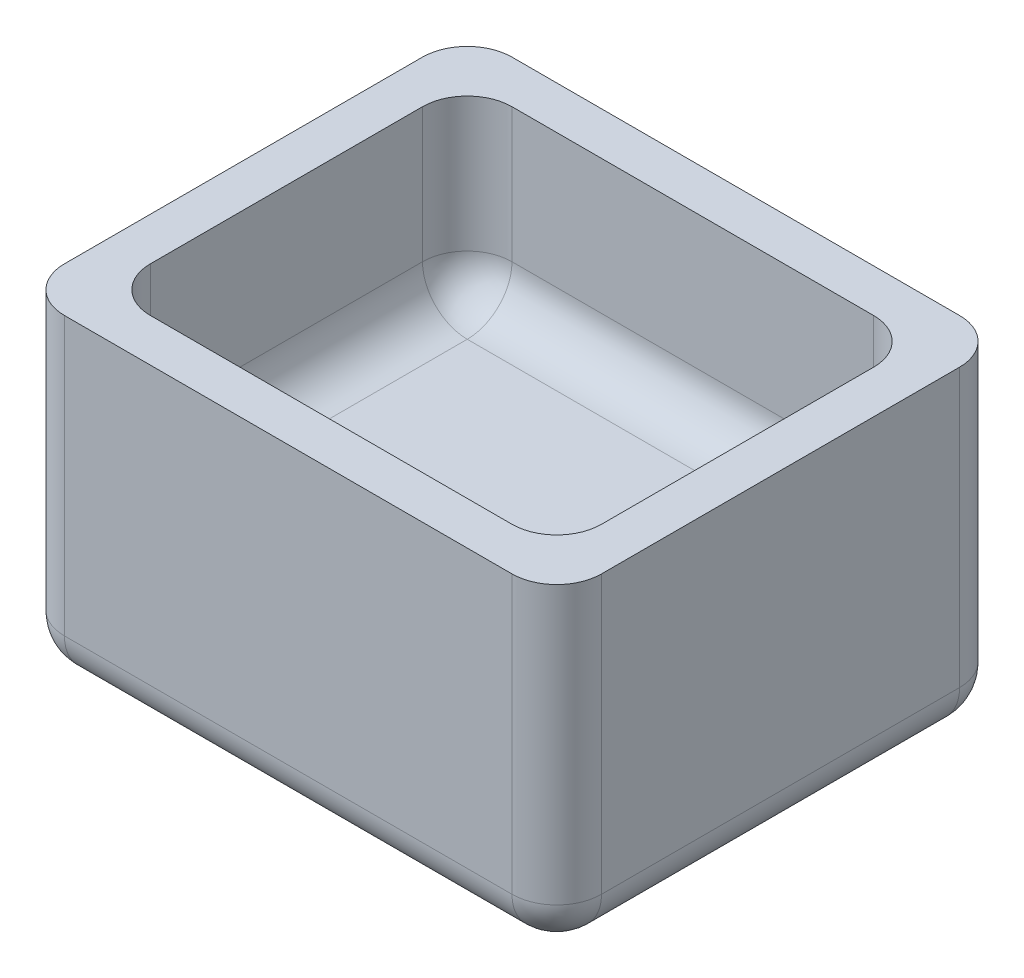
ISO-10303-21;
HEADER;
FILE_DESCRIPTION(('STEP AP214'),'2;1');
FILE_NAME('part.step','',(''),(''),'','','');
FILE_SCHEMA(('AUTOMOTIVE_DESIGN { 1 0 10303 214 1 1 1 1 }'));
ENDSEC;
DATA;
#1=APPLICATION_CONTEXT('core data for automotive mechanical design processes');
#2=APPLICATION_PROTOCOL_DEFINITION('international standard','automotive_design',2000,#1);
#3=PRODUCT_CONTEXT('',#1,'mechanical');
#4=PRODUCT('Part','Part','',(#3));
#5=PRODUCT_RELATED_PRODUCT_CATEGORY('part','',(#4));
#6=PRODUCT_DEFINITION_FORMATION('','',#4);
#7=PRODUCT_DEFINITION_CONTEXT('part definition',#1,'design');
#8=PRODUCT_DEFINITION('design','',#6,#7);
#9=PRODUCT_DEFINITION_SHAPE('','',#8);
#10=(LENGTH_UNIT() NAMED_UNIT(*) SI_UNIT(.MILLI.,.METRE.));
#11=(NAMED_UNIT(*) PLANE_ANGLE_UNIT() SI_UNIT($,.RADIAN.));
#12=(NAMED_UNIT(*) SI_UNIT($,.STERADIAN.) SOLID_ANGLE_UNIT());
#13=UNCERTAINTY_MEASURE_WITH_UNIT(LENGTH_MEASURE(1.E-05),#10,'distance_accuracy_value','');
#14=(GEOMETRIC_REPRESENTATION_CONTEXT(3) GLOBAL_UNCERTAINTY_ASSIGNED_CONTEXT((#13)) GLOBAL_UNIT_ASSIGNED_CONTEXT((#10,
#11,#12)) REPRESENTATION_CONTEXT('',''));
#15=CARTESIAN_POINT('',(0.,0.,0.));
#16=DIRECTION('',(0.,0.,1.));
#17=DIRECTION('',(1.,0.,0.));
#18=AXIS2_PLACEMENT_3D('',#15,#16,#17);
#19=CARTESIAN_POINT('',(-15.,3.,-12.5));
#20=DIRECTION('',(1.,0.,0.));
#21=DIRECTION('',(0.,0.,-1.));
#22=AXIS2_PLACEMENT_3D('',#19,#20,#21);
#23=PLANE('',#22);
#24=DIRECTION('',(0.,0.,1.));
#25=VECTOR('',#24,1.);
#26=CARTESIAN_POINT('',(-15.,-12.5,12.5));
#27=LINE('',#26,#25);
#28=CARTESIAN_POINT('',(-15.,-12.5,-10.));
#29=VERTEX_POINT('',#28);
#30=CARTESIAN_POINT('',(-15.,-12.5,10.));
#31=VERTEX_POINT('',#30);
#32=EDGE_CURVE('E294',#29,#31,#27,.T.);
#33=ORIENTED_EDGE('',*,*,#32,.T.);
#34=DIRECTION('',(0.,-1.,0.));
#35=VECTOR('',#34,1.);
#36=CARTESIAN_POINT('',(-15.,3.,10.));
#37=LINE('',#36,#35);
#38=CARTESIAN_POINT('',(-15.,3.,10.));
#39=VERTEX_POINT('',#38);
#40=EDGE_CURVE('E296',#31,#39,#37,.F.);
#41=ORIENTED_EDGE('',*,*,#40,.T.);
#42=DIRECTION('',(0.,0.,1.));
#43=VECTOR('',#42,1.);
#44=CARTESIAN_POINT('',(-15.,3.,-12.5));
#45=LINE('',#44,#43);
#46=CARTESIAN_POINT('',(-15.,3.,-10.));
#47=VERTEX_POINT('',#46);
#48=EDGE_CURVE('E366',#47,#39,#45,.T.);
#49=ORIENTED_EDGE('',*,*,#48,.F.);
#50=DIRECTION('',(0.,-1.,0.));
#51=VECTOR('',#50,1.);
#52=CARTESIAN_POINT('',(-15.,3.,-10.));
#53=LINE('',#52,#51);
#54=EDGE_CURVE('E292',#47,#29,#53,.T.);
#55=ORIENTED_EDGE('',*,*,#54,.T.);
#56=EDGE_LOOP('',(#33,#41,#49,#55));
#57=FACE_BOUND('',#56,.T.);
#58=ADVANCED_FACE('F33',(#57),#23,.F.);
#59=CARTESIAN_POINT('',(15.,3.,12.5));
#60=DIRECTION('',(0.,0.,-1.));
#61=DIRECTION('',(-1.,0.,0.));
#62=AXIS2_PLACEMENT_3D('',#59,#60,#61);
#63=PLANE('',#62);
#64=DIRECTION('',(1.,0.,0.));
#65=VECTOR('',#64,1.);
#66=CARTESIAN_POINT('',(15.,-12.5,12.5));
#67=LINE('',#66,#65);
#68=CARTESIAN_POINT('',(-12.5,-12.5,12.5));
#69=VERTEX_POINT('',#68);
#70=CARTESIAN_POINT('',(12.5,-12.5,12.5));
#71=VERTEX_POINT('',#70);
#72=EDGE_CURVE('E50',#69,#71,#67,.T.);
#73=ORIENTED_EDGE('',*,*,#72,.T.);
#74=DIRECTION('',(0.,-1.,0.));
#75=VECTOR('',#74,1.);
#76=CARTESIAN_POINT('',(12.5,3.,12.5));
#77=LINE('',#76,#75);
#78=CARTESIAN_POINT('',(12.5,3.,12.5));
#79=VERTEX_POINT('',#78);
#80=EDGE_CURVE('E300',#71,#79,#77,.F.);
#81=ORIENTED_EDGE('',*,*,#80,.T.);
#82=DIRECTION('',(1.,0.,0.));
#83=VECTOR('',#82,1.);
#84=CARTESIAN_POINT('',(15.,3.,12.5));
#85=LINE('',#84,#83);
#86=CARTESIAN_POINT('',(-12.5,3.,12.5));
#87=VERTEX_POINT('',#86);
#88=EDGE_CURVE('E359',#87,#79,#85,.T.);
#89=ORIENTED_EDGE('',*,*,#88,.F.);
#90=DIRECTION('',(0.,-1.,0.));
#91=VECTOR('',#90,1.);
#92=CARTESIAN_POINT('',(-12.5,3.,12.5));
#93=LINE('',#92,#91);
#94=EDGE_CURVE('E55',#87,#69,#93,.T.);
#95=ORIENTED_EDGE('',*,*,#94,.T.);
#96=EDGE_LOOP('',(#73,#81,#89,#95));
#97=FACE_BOUND('',#96,.T.);
#98=ADVANCED_FACE('F358',(#97),#63,.F.);
#99=CARTESIAN_POINT('',(15.,3.,-12.5));
#100=DIRECTION('',(-1.,0.,0.));
#101=DIRECTION('',(0.,0.,1.));
#102=AXIS2_PLACEMENT_3D('',#99,#100,#101);
#103=PLANE('',#102);
#104=DIRECTION('',(0.,0.,-1.));
#105=VECTOR('',#104,1.);
#106=CARTESIAN_POINT('',(15.,3.,-12.5));
#107=LINE('',#106,#105);
#108=CARTESIAN_POINT('',(15.,3.,10.));
#109=VERTEX_POINT('',#108);
#110=CARTESIAN_POINT('',(15.,3.,-10.));
#111=VERTEX_POINT('',#110);
#112=EDGE_CURVE('E210',#109,#111,#107,.T.);
#113=ORIENTED_EDGE('',*,*,#112,.F.);
#114=DIRECTION('',(0.,-1.,0.));
#115=VECTOR('',#114,1.);
#116=CARTESIAN_POINT('',(15.,3.,10.));
#117=LINE('',#116,#115);
#118=CARTESIAN_POINT('',(15.,-12.5,10.));
#119=VERTEX_POINT('',#118);
#120=EDGE_CURVE('E275',#109,#119,#117,.T.);
#121=ORIENTED_EDGE('',*,*,#120,.T.);
#122=DIRECTION('',(0.,0.,-1.));
#123=VECTOR('',#122,1.);
#124=CARTESIAN_POINT('',(15.,-12.5,-12.5));
#125=LINE('',#124,#123);
#126=CARTESIAN_POINT('',(15.,-12.5,-10.));
#127=VERTEX_POINT('',#126);
#128=EDGE_CURVE('E272',#119,#127,#125,.T.);
#129=ORIENTED_EDGE('',*,*,#128,.T.);
#130=DIRECTION('',(0.,-1.,0.));
#131=VECTOR('',#130,1.);
#132=CARTESIAN_POINT('',(15.,3.,-10.));
#133=LINE('',#132,#131);
#134=EDGE_CURVE('E249',#127,#111,#133,.F.);
#135=ORIENTED_EDGE('',*,*,#134,.T.);
#136=EDGE_LOOP('',(#113,#121,#129,#135));
#137=FACE_BOUND('',#136,.T.);
#138=ADVANCED_FACE('F439',(#137),#103,.F.);
#139=CARTESIAN_POINT('',(15.,3.,-12.5));
#140=DIRECTION('',(0.,0.,1.));
#141=DIRECTION('',(1.,0.,0.));
#142=AXIS2_PLACEMENT_3D('',#139,#140,#141);
#143=PLANE('',#142);
#144=DIRECTION('',(-1.,0.,0.));
#145=VECTOR('',#144,1.);
#146=CARTESIAN_POINT('',(15.,3.,-12.5));
#147=LINE('',#146,#145);
#148=CARTESIAN_POINT('',(12.5,3.,-12.5));
#149=VERTEX_POINT('',#148);
#150=CARTESIAN_POINT('',(-12.5,3.,-12.5));
#151=VERTEX_POINT('',#150);
#152=EDGE_CURVE('E207',#149,#151,#147,.T.);
#153=ORIENTED_EDGE('',*,*,#152,.F.);
#154=DIRECTION('',(0.,-1.,0.));
#155=VECTOR('',#154,1.);
#156=CARTESIAN_POINT('',(12.5,3.,-12.5));
#157=LINE('',#156,#155);
#158=CARTESIAN_POINT('',(12.5,-12.5,-12.5));
#159=VERTEX_POINT('',#158);
#160=EDGE_CURVE('E290',#149,#159,#157,.T.);
#161=ORIENTED_EDGE('',*,*,#160,.T.);
#162=DIRECTION('',(-1.,0.,0.));
#163=VECTOR('',#162,1.);
#164=CARTESIAN_POINT('',(-15.,-12.5,-12.5));
#165=LINE('',#164,#163);
#166=CARTESIAN_POINT('',(-12.5,-12.5,-12.5));
#167=VERTEX_POINT('',#166);
#168=EDGE_CURVE('E288',#159,#167,#165,.T.);
#169=ORIENTED_EDGE('',*,*,#168,.T.);
#170=DIRECTION('',(0.,-1.,0.));
#171=VECTOR('',#170,1.);
#172=CARTESIAN_POINT('',(-12.5,3.,-12.5));
#173=LINE('',#172,#171);
#174=EDGE_CURVE('E286',#167,#151,#173,.F.);
#175=ORIENTED_EDGE('',*,*,#174,.T.);
#176=EDGE_LOOP('',(#153,#161,#169,#175));
#177=FACE_BOUND('',#176,.T.);
#178=ADVANCED_FACE('F692',(#177),#143,.F.);
#179=CARTESIAN_POINT('',(-15.,3.,12.5));
#180=DIRECTION('',(0.,-1.,0.));
#181=DIRECTION('',(0.,0.,-1.));
#182=AXIS2_PLACEMENT_3D('',#179,#180,#181);
#183=PLANE('',#182);
#184=DIRECTION('',(0.,0.,1.));
#185=VECTOR('',#184,1.);
#186=CARTESIAN_POINT('',(-12.6,3.,-10.1));
#187=LINE('',#186,#185);
#188=CARTESIAN_POINT('',(-12.6,3.,-7.6));
#189=VERTEX_POINT('',#188);
#190=CARTESIAN_POINT('',(-12.6,3.,7.6));
#191=VERTEX_POINT('',#190);
#192=EDGE_CURVE('E376',#189,#191,#187,.T.);
#193=ORIENTED_EDGE('',*,*,#192,.F.);
#194=CARTESIAN_POINT('',(-10.1,3.,-7.6));
#195=DIRECTION('',(0.,-1.,0.));
#196=DIRECTION('',(0.,0.,-1.));
#197=AXIS2_PLACEMENT_3D('',#194,#195,#196);
#198=CIRCLE('',#197,2.5);
#199=CARTESIAN_POINT('',(-10.1,3.,-10.1));
#200=VERTEX_POINT('',#199);
#201=EDGE_CURVE('E247',#189,#200,#198,.T.);
#202=ORIENTED_EDGE('',*,*,#201,.T.);
#203=DIRECTION('',(-1.,0.,0.));
#204=VECTOR('',#203,1.);
#205=CARTESIAN_POINT('',(12.6,3.,-10.1));
#206=LINE('',#205,#204);
#207=CARTESIAN_POINT('',(10.1,3.,-10.1));
#208=VERTEX_POINT('',#207);
#209=EDGE_CURVE('E270',#208,#200,#206,.T.);
#210=ORIENTED_EDGE('',*,*,#209,.F.);
#211=CARTESIAN_POINT('',(10.1,3.,-7.6));
#212=DIRECTION('',(0.,-1.,0.));
#213=DIRECTION('',(0.,0.,-1.));
#214=AXIS2_PLACEMENT_3D('',#211,#212,#213);
#215=CIRCLE('',#214,2.5);
#216=CARTESIAN_POINT('',(12.6,3.,-7.6));
#217=VERTEX_POINT('',#216);
#218=EDGE_CURVE('E241',#208,#217,#215,.T.);
#219=ORIENTED_EDGE('',*,*,#218,.T.);
#220=DIRECTION('',(0.,0.,-1.));
#221=VECTOR('',#220,1.);
#222=CARTESIAN_POINT('',(12.6,3.,10.1));
#223=LINE('',#222,#221);
#224=CARTESIAN_POINT('',(12.6,3.,7.6));
#225=VERTEX_POINT('',#224);
#226=EDGE_CURVE('E368',#225,#217,#223,.T.);
#227=ORIENTED_EDGE('',*,*,#226,.F.);
#228=CARTESIAN_POINT('',(10.1,3.,7.6));
#229=DIRECTION('',(0.,-1.,0.));
#230=DIRECTION('',(0.,0.,-1.));
#231=AXIS2_PLACEMENT_3D('',#228,#229,#230);
#232=CIRCLE('',#231,2.5);
#233=CARTESIAN_POINT('',(10.1,3.,10.1));
#234=VERTEX_POINT('',#233);
#235=EDGE_CURVE('E243',#225,#234,#232,.T.);
#236=ORIENTED_EDGE('',*,*,#235,.T.);
#237=DIRECTION('',(1.,0.,0.));
#238=VECTOR('',#237,1.);
#239=CARTESIAN_POINT('',(-12.6,3.,10.1));
#240=LINE('',#239,#238);
#241=CARTESIAN_POINT('',(-10.1,3.,10.1));
#242=VERTEX_POINT('',#241);
#243=EDGE_CURVE('E373',#242,#234,#240,.T.);
#244=ORIENTED_EDGE('',*,*,#243,.F.);
#245=CARTESIAN_POINT('',(-10.1,3.,7.6));
#246=DIRECTION('',(0.,-1.,0.));
#247=DIRECTION('',(0.,0.,-1.));
#248=AXIS2_PLACEMENT_3D('',#245,#246,#247);
#249=CIRCLE('',#248,2.5);
#250=EDGE_CURVE('E245',#242,#191,#249,.T.);
#251=ORIENTED_EDGE('',*,*,#250,.T.);
#252=EDGE_LOOP('',(#193,#202,#210,#219,#227,#236,#244,#251));
#253=FACE_BOUND('',#252,.T.);
#254=ORIENTED_EDGE('',*,*,#88,.T.);
#255=CARTESIAN_POINT('',(12.5,3.,10.));
#256=DIRECTION('',(0.,-1.,0.));
#257=DIRECTION('',(0.,0.,-1.));
#258=AXIS2_PLACEMENT_3D('',#255,#256,#257);
#259=CIRCLE('',#258,2.5);
#260=EDGE_CURVE('E11',#79,#109,#259,.F.);
#261=ORIENTED_EDGE('',*,*,#260,.T.);
#262=ORIENTED_EDGE('',*,*,#112,.T.);
#263=CARTESIAN_POINT('',(12.5,3.,-10.));
#264=DIRECTION('',(0.,-1.,0.));
#265=DIRECTION('',(0.,0.,-1.));
#266=AXIS2_PLACEMENT_3D('',#263,#264,#265);
#267=CIRCLE('',#266,2.5);
#268=EDGE_CURVE('E42',#111,#149,#267,.F.);
#269=ORIENTED_EDGE('',*,*,#268,.T.);
#270=ORIENTED_EDGE('',*,*,#152,.T.);
#271=CARTESIAN_POINT('',(-12.5,3.,-10.));
#272=DIRECTION('',(0.,-1.,0.));
#273=DIRECTION('',(0.,0.,-1.));
#274=AXIS2_PLACEMENT_3D('',#271,#272,#273);
#275=CIRCLE('',#274,2.5);
#276=EDGE_CURVE('E302',#151,#47,#275,.F.);
#277=ORIENTED_EDGE('',*,*,#276,.T.);
#278=ORIENTED_EDGE('',*,*,#48,.T.);
#279=CARTESIAN_POINT('',(-12.5,3.,10.));
#280=DIRECTION('',(0.,-1.,0.));
#281=DIRECTION('',(0.,0.,-1.));
#282=AXIS2_PLACEMENT_3D('',#279,#280,#281);
#283=CIRCLE('',#282,2.5);
#284=EDGE_CURVE('E304',#39,#87,#283,.F.);
#285=ORIENTED_EDGE('',*,*,#284,.T.);
#286=EDGE_LOOP('',(#254,#261,#262,#269,#270,#277,#278,#285));
#287=FACE_BOUND('',#286,.T.);
#288=ADVANCED_FACE('F361',(#253,#287),#183,.F.);
#289=CARTESIAN_POINT('',(-15.,-15.,12.5));
#290=DIRECTION('',(0.,-1.,0.));
#291=DIRECTION('',(0.,0.,-1.));
#292=AXIS2_PLACEMENT_3D('',#289,#290,#291);
#293=PLANE('',#292);
#294=DIRECTION('',(-1.,0.,0.));
#295=VECTOR('',#294,1.);
#296=CARTESIAN_POINT('',(15.,-15.,-10.));
#297=LINE('',#296,#295);
#298=CARTESIAN_POINT('',(-12.5,-15.,-10.));
#299=VERTEX_POINT('',#298);
#300=CARTESIAN_POINT('',(12.5,-15.,-10.));
#301=VERTEX_POINT('',#300);
#302=EDGE_CURVE('E281',#299,#301,#297,.F.);
#303=ORIENTED_EDGE('',*,*,#302,.T.);
#304=DIRECTION('',(0.,0.,-1.));
#305=VECTOR('',#304,1.);
#306=CARTESIAN_POINT('',(12.5,-15.,12.5));
#307=LINE('',#306,#305);
#308=CARTESIAN_POINT('',(12.5,-15.,10.));
#309=VERTEX_POINT('',#308);
#310=EDGE_CURVE('E283',#301,#309,#307,.F.);
#311=ORIENTED_EDGE('',*,*,#310,.T.);
#312=DIRECTION('',(1.,0.,0.));
#313=VECTOR('',#312,1.);
#314=CARTESIAN_POINT('',(-15.,-15.,10.));
#315=LINE('',#314,#313);
#316=CARTESIAN_POINT('',(-12.5,-15.,10.));
#317=VERTEX_POINT('',#316);
#318=EDGE_CURVE('E277',#309,#317,#315,.F.);
#319=ORIENTED_EDGE('',*,*,#318,.T.);
#320=DIRECTION('',(0.,0.,1.));
#321=VECTOR('',#320,1.);
#322=CARTESIAN_POINT('',(-12.5,-15.,-12.5));
#323=LINE('',#322,#321);
#324=EDGE_CURVE('E279',#317,#299,#323,.F.);
#325=ORIENTED_EDGE('',*,*,#324,.T.);
#326=EDGE_LOOP('',(#303,#311,#319,#325));
#327=FACE_BOUND('',#326,.T.);
#328=ADVANCED_FACE('F677',(#327),#293,.T.);
#329=CARTESIAN_POINT('',(12.6,-7.,-10.1));
#330=DIRECTION('',(0.,0.,-1.));
#331=DIRECTION('',(-1.,0.,0.));
#332=AXIS2_PLACEMENT_3D('',#329,#330,#331);
#333=PLANE('',#332);
#334=DIRECTION('',(-1.,0.,0.));
#335=VECTOR('',#334,1.);
#336=CARTESIAN_POINT('',(12.6,-4.5,-10.1));
#337=LINE('',#336,#335);
#338=CARTESIAN_POINT('',(-10.1,-4.5,-10.1));
#339=VERTEX_POINT('',#338);
#340=CARTESIAN_POINT('',(10.1,-4.5,-10.1));
#341=VERTEX_POINT('',#340);
#342=EDGE_CURVE('E237',#339,#341,#337,.F.);
#343=ORIENTED_EDGE('',*,*,#342,.T.);
#344=DIRECTION('',(0.,1.,0.));
#345=VECTOR('',#344,1.);
#346=CARTESIAN_POINT('',(10.1,3.,-10.1));
#347=LINE('',#346,#345);
#348=EDGE_CURVE('E239',#341,#208,#347,.T.);
#349=ORIENTED_EDGE('',*,*,#348,.T.);
#350=ORIENTED_EDGE('',*,*,#209,.T.);
#351=DIRECTION('',(0.,1.,0.));
#352=VECTOR('',#351,1.);
#353=CARTESIAN_POINT('',(-10.1,-7.,-10.1));
#354=LINE('',#353,#352);
#355=EDGE_CURVE('E235',#200,#339,#354,.F.);
#356=ORIENTED_EDGE('',*,*,#355,.T.);
#357=EDGE_LOOP('',(#343,#349,#350,#356));
#358=FACE_BOUND('',#357,.T.);
#359=ADVANCED_FACE('F383',(#358),#333,.F.);
#360=CARTESIAN_POINT('',(12.6,-7.,10.1));
#361=DIRECTION('',(1.,0.,0.));
#362=DIRECTION('',(0.,0.,-1.));
#363=AXIS2_PLACEMENT_3D('',#360,#361,#362);
#364=PLANE('',#363);
#365=ORIENTED_EDGE('',*,*,#226,.T.);
#366=DIRECTION('',(0.,1.,0.));
#367=VECTOR('',#366,1.);
#368=CARTESIAN_POINT('',(12.6,-7.,-7.6));
#369=LINE('',#368,#367);
#370=CARTESIAN_POINT('',(12.6,-4.5,-7.6));
#371=VERTEX_POINT('',#370);
#372=EDGE_CURVE('E233',#217,#371,#369,.F.);
#373=ORIENTED_EDGE('',*,*,#372,.T.);
#374=DIRECTION('',(0.,0.,-1.));
#375=VECTOR('',#374,1.);
#376=CARTESIAN_POINT('',(12.6,-4.5,10.1));
#377=LINE('',#376,#375);
#378=CARTESIAN_POINT('',(12.6,-4.5,7.6));
#379=VERTEX_POINT('',#378);
#380=EDGE_CURVE('E188',#371,#379,#377,.F.);
#381=ORIENTED_EDGE('',*,*,#380,.T.);
#382=DIRECTION('',(0.,1.,0.));
#383=VECTOR('',#382,1.);
#384=CARTESIAN_POINT('',(12.6,3.,7.6));
#385=LINE('',#384,#383);
#386=EDGE_CURVE('E230',#379,#225,#385,.T.);
#387=ORIENTED_EDGE('',*,*,#386,.T.);
#388=EDGE_LOOP('',(#365,#373,#381,#387));
#389=FACE_BOUND('',#388,.T.);
#390=ADVANCED_FACE('F417',(#389),#364,.F.);
#391=CARTESIAN_POINT('',(-12.6,-7.,10.1));
#392=DIRECTION('',(0.,0.,1.));
#393=DIRECTION('',(1.,0.,0.));
#394=AXIS2_PLACEMENT_3D('',#391,#392,#393);
#395=PLANE('',#394);
#396=ORIENTED_EDGE('',*,*,#243,.T.);
#397=DIRECTION('',(0.,1.,0.));
#398=VECTOR('',#397,1.);
#399=CARTESIAN_POINT('',(10.1,-7.,10.1));
#400=LINE('',#399,#398);
#401=CARTESIAN_POINT('',(10.1,-4.5,10.1));
#402=VERTEX_POINT('',#401);
#403=EDGE_CURVE('E228',#234,#402,#400,.F.);
#404=ORIENTED_EDGE('',*,*,#403,.T.);
#405=DIRECTION('',(1.,0.,0.));
#406=VECTOR('',#405,1.);
#407=CARTESIAN_POINT('',(-12.6,-4.5,10.1));
#408=LINE('',#407,#406);
#409=CARTESIAN_POINT('',(-10.1,-4.5,10.1));
#410=VERTEX_POINT('',#409);
#411=EDGE_CURVE('E226',#402,#410,#408,.F.);
#412=ORIENTED_EDGE('',*,*,#411,.T.);
#413=DIRECTION('',(0.,1.,0.));
#414=VECTOR('',#413,1.);
#415=CARTESIAN_POINT('',(-10.1,3.,10.1));
#416=LINE('',#415,#414);
#417=EDGE_CURVE('E224',#410,#242,#416,.T.);
#418=ORIENTED_EDGE('',*,*,#417,.T.);
#419=EDGE_LOOP('',(#396,#404,#412,#418));
#420=FACE_BOUND('',#419,.T.);
#421=ADVANCED_FACE('F653',(#420),#395,.F.);
#422=CARTESIAN_POINT('',(-12.6,-7.,-10.1));
#423=DIRECTION('',(-1.,0.,0.));
#424=DIRECTION('',(0.,0.,1.));
#425=AXIS2_PLACEMENT_3D('',#422,#423,#424);
#426=PLANE('',#425);
#427=ORIENTED_EDGE('',*,*,#192,.T.);
#428=DIRECTION('',(0.,1.,0.));
#429=VECTOR('',#428,1.);
#430=CARTESIAN_POINT('',(-12.6,-7.,7.6));
#431=LINE('',#430,#429);
#432=CARTESIAN_POINT('',(-12.6,-4.5,7.6));
#433=VERTEX_POINT('',#432);
#434=EDGE_CURVE('E222',#191,#433,#431,.F.);
#435=ORIENTED_EDGE('',*,*,#434,.T.);
#436=DIRECTION('',(0.,0.,1.));
#437=VECTOR('',#436,1.);
#438=CARTESIAN_POINT('',(-12.6,-4.5,-10.1));
#439=LINE('',#438,#437);
#440=CARTESIAN_POINT('',(-12.6,-4.5,-7.6));
#441=VERTEX_POINT('',#440);
#442=EDGE_CURVE('E219',#433,#441,#439,.F.);
#443=ORIENTED_EDGE('',*,*,#442,.T.);
#444=DIRECTION('',(0.,1.,0.));
#445=VECTOR('',#444,1.);
#446=CARTESIAN_POINT('',(-12.6,3.,-7.6));
#447=LINE('',#446,#445);
#448=EDGE_CURVE('E217',#441,#189,#447,.T.);
#449=ORIENTED_EDGE('',*,*,#448,.T.);
#450=EDGE_LOOP('',(#427,#435,#443,#449));
#451=FACE_BOUND('',#450,.T.);
#452=ADVANCED_FACE('F430',(#451),#426,.F.);
#453=CARTESIAN_POINT('',(-12.6,-7.,-10.1));
#454=DIRECTION('',(0.,1.,0.));
#455=DIRECTION('',(0.,0.,1.));
#456=AXIS2_PLACEMENT_3D('',#453,#454,#455);
#457=PLANE('',#456);
#458=DIRECTION('',(-1.,0.,0.));
#459=VECTOR('',#458,1.);
#460=CARTESIAN_POINT('',(-12.6,-7.,-7.6));
#461=LINE('',#460,#459);
#462=CARTESIAN_POINT('',(10.1,-7.,-7.6));
#463=VERTEX_POINT('',#462);
#464=CARTESIAN_POINT('',(-10.1,-7.,-7.6));
#465=VERTEX_POINT('',#464);
#466=EDGE_CURVE('E175',#463,#465,#461,.T.);
#467=ORIENTED_EDGE('',*,*,#466,.T.);
#468=DIRECTION('',(0.,0.,1.));
#469=VECTOR('',#468,1.);
#470=CARTESIAN_POINT('',(-10.1,-7.,-10.1));
#471=LINE('',#470,#469);
#472=CARTESIAN_POINT('',(-10.1,-7.,7.6));
#473=VERTEX_POINT('',#472);
#474=EDGE_CURVE('E215',#465,#473,#471,.T.);
#475=ORIENTED_EDGE('',*,*,#474,.T.);
#476=DIRECTION('',(1.,0.,0.));
#477=VECTOR('',#476,1.);
#478=CARTESIAN_POINT('',(-12.6,-7.,7.6));
#479=LINE('',#478,#477);
#480=CARTESIAN_POINT('',(10.1,-7.,7.6));
#481=VERTEX_POINT('',#480);
#482=EDGE_CURVE('E178',#473,#481,#479,.T.);
#483=ORIENTED_EDGE('',*,*,#482,.T.);
#484=DIRECTION('',(0.,0.,-1.));
#485=VECTOR('',#484,1.);
#486=CARTESIAN_POINT('',(10.1,-7.,-10.1));
#487=LINE('',#486,#485);
#488=EDGE_CURVE('E170',#481,#463,#487,.T.);
#489=ORIENTED_EDGE('',*,*,#488,.T.);
#490=EDGE_LOOP('',(#467,#475,#483,#489));
#491=FACE_BOUND('',#490,.T.);
#492=ADVANCED_FACE('F172',(#491),#457,.T.);
#493=CARTESIAN_POINT('',(10.1,-7.,-7.6));
#494=DIRECTION('',(0.,-1.,0.));
#495=DIRECTION('',(0.,0.,-1.));
#496=AXIS2_PLACEMENT_3D('',#493,#494,#495);
#497=CYLINDRICAL_SURFACE('',#496,2.5);
#498=ORIENTED_EDGE('',*,*,#218,.F.);
#499=ORIENTED_EDGE('',*,*,#348,.F.);
#500=CARTESIAN_POINT('',(10.1,-4.5,-7.6));
#501=DIRECTION('',(0.,1.,0.));
#502=DIRECTION('',(0.,0.,1.));
#503=AXIS2_PLACEMENT_3D('',#500,#501,#502);
#504=CIRCLE('',#503,2.5);
#505=EDGE_CURVE('E192',#371,#341,#504,.T.);
#506=ORIENTED_EDGE('',*,*,#505,.F.);
#507=ORIENTED_EDGE('',*,*,#372,.F.);
#508=EDGE_LOOP('',(#498,#499,#506,#507));
#509=FACE_BOUND('',#508,.T.);
#510=ADVANCED_FACE('F422',(#509),#497,.F.);
#511=CARTESIAN_POINT('',(10.1,-4.5,-10.1));
#512=DIRECTION('',(0.,0.,-1.));
#513=DIRECTION('',(-1.,0.,0.));
#514=AXIS2_PLACEMENT_3D('',#511,#512,#513);
#515=CYLINDRICAL_SURFACE('',#514,2.5);
#516=CARTESIAN_POINT('',(10.1,-4.5,7.6));
#517=DIRECTION('',(0.,0.,-1.));
#518=DIRECTION('',(0.,1.,0.));
#519=AXIS2_PLACEMENT_3D('',#516,#517,#518);
#520=CIRCLE('',#519,2.5);
#521=EDGE_CURVE('E193',#379,#481,#520,.T.);
#522=ORIENTED_EDGE('',*,*,#521,.F.);
#523=ORIENTED_EDGE('',*,*,#380,.F.);
#524=CARTESIAN_POINT('',(10.1,-4.5,-7.6));
#525=DIRECTION('',(0.,0.,1.));
#526=DIRECTION('',(1.,0.,0.));
#527=AXIS2_PLACEMENT_3D('',#524,#525,#526);
#528=CIRCLE('',#527,2.5);
#529=EDGE_CURVE('E185',#463,#371,#528,.T.);
#530=ORIENTED_EDGE('',*,*,#529,.F.);
#531=ORIENTED_EDGE('',*,*,#488,.F.);
#532=EDGE_LOOP('',(#522,#523,#530,#531));
#533=FACE_BOUND('',#532,.T.);
#534=ADVANCED_FACE('F187',(#533),#515,.F.);
#535=CARTESIAN_POINT('',(10.1,-7.,7.6));
#536=DIRECTION('',(0.,-1.,0.));
#537=DIRECTION('',(0.,0.,-1.));
#538=AXIS2_PLACEMENT_3D('',#535,#536,#537);
#539=CYLINDRICAL_SURFACE('',#538,2.5);
#540=ORIENTED_EDGE('',*,*,#235,.F.);
#541=ORIENTED_EDGE('',*,*,#386,.F.);
#542=CARTESIAN_POINT('',(10.1,-4.5,7.6));
#543=DIRECTION('',(0.,1.,0.));
#544=DIRECTION('',(0.,0.,1.));
#545=AXIS2_PLACEMENT_3D('',#542,#543,#544);
#546=CIRCLE('',#545,2.5);
#547=EDGE_CURVE('E200',#402,#379,#546,.T.);
#548=ORIENTED_EDGE('',*,*,#547,.F.);
#549=ORIENTED_EDGE('',*,*,#403,.F.);
#550=EDGE_LOOP('',(#540,#541,#548,#549));
#551=FACE_BOUND('',#550,.T.);
#552=ADVANCED_FACE('F414',(#551),#539,.F.);
#553=CARTESIAN_POINT('',(10.1,-4.5,-7.6));
#554=DIRECTION('',(0.,0.,1.));
#555=DIRECTION('',(1.,0.,0.));
#556=AXIS2_PLACEMENT_3D('',#553,#554,#555);
#557=SPHERICAL_SURFACE('',#556,2.5);
#558=ORIENTED_EDGE('',*,*,#529,.T.);
#559=ORIENTED_EDGE('',*,*,#505,.T.);
#560=CARTESIAN_POINT('',(10.1,-4.5,-7.6));
#561=DIRECTION('',(-1.,0.,0.));
#562=DIRECTION('',(0.,0.,1.));
#563=AXIS2_PLACEMENT_3D('',#560,#561,#562);
#564=CIRCLE('',#563,2.5);
#565=EDGE_CURVE('E196',#463,#341,#564,.F.);
#566=ORIENTED_EDGE('',*,*,#565,.F.);
#567=EDGE_LOOP('',(#558,#559,#566));
#568=FACE_BOUND('',#567,.T.);
#569=ADVANCED_FACE('F197',(#568),#557,.F.);
#570=CARTESIAN_POINT('',(10.1,-4.5,7.6));
#571=DIRECTION('',(0.,0.,1.));
#572=DIRECTION('',(1.,0.,0.));
#573=AXIS2_PLACEMENT_3D('',#570,#571,#572);
#574=SPHERICAL_SURFACE('',#573,2.5);
#575=ORIENTED_EDGE('',*,*,#547,.T.);
#576=ORIENTED_EDGE('',*,*,#521,.T.);
#577=CARTESIAN_POINT('',(10.1,-4.5,7.6));
#578=DIRECTION('',(-1.,0.,0.));
#579=DIRECTION('',(0.,0.,1.));
#580=AXIS2_PLACEMENT_3D('',#577,#578,#579);
#581=CIRCLE('',#580,2.5);
#582=EDGE_CURVE('E201',#402,#481,#581,.F.);
#583=ORIENTED_EDGE('',*,*,#582,.F.);
#584=EDGE_LOOP('',(#575,#576,#583));
#585=FACE_BOUND('',#584,.T.);
#586=ADVANCED_FACE('F408',(#585),#574,.F.);
#587=CARTESIAN_POINT('',(-10.1,-7.,-7.6));
#588=DIRECTION('',(0.,-1.,0.));
#589=DIRECTION('',(0.,0.,-1.));
#590=AXIS2_PLACEMENT_3D('',#587,#588,#589);
#591=CYLINDRICAL_SURFACE('',#590,2.5);
#592=ORIENTED_EDGE('',*,*,#201,.F.);
#593=ORIENTED_EDGE('',*,*,#448,.F.);
#594=CARTESIAN_POINT('',(-10.1,-4.5,-7.6));
#595=DIRECTION('',(0.,1.,0.));
#596=DIRECTION('',(0.,0.,1.));
#597=AXIS2_PLACEMENT_3D('',#594,#595,#596);
#598=CIRCLE('',#597,2.5);
#599=EDGE_CURVE('E261',#339,#441,#598,.T.);
#600=ORIENTED_EDGE('',*,*,#599,.F.);
#601=ORIENTED_EDGE('',*,*,#355,.F.);
#602=EDGE_LOOP('',(#592,#593,#600,#601));
#603=FACE_BOUND('',#602,.T.);
#604=ADVANCED_FACE('F390',(#603),#591,.F.);
#605=CARTESIAN_POINT('',(-12.6,-4.5,-7.6));
#606=DIRECTION('',(-1.,0.,0.));
#607=DIRECTION('',(0.,0.,1.));
#608=AXIS2_PLACEMENT_3D('',#605,#606,#607);
#609=CYLINDRICAL_SURFACE('',#608,2.5);
#610=ORIENTED_EDGE('',*,*,#565,.T.);
#611=ORIENTED_EDGE('',*,*,#342,.F.);
#612=CARTESIAN_POINT('',(-10.1,-4.5,-7.6));
#613=DIRECTION('',(1.,0.,0.));
#614=DIRECTION('',(0.,0.,-1.));
#615=AXIS2_PLACEMENT_3D('',#612,#613,#614);
#616=CIRCLE('',#615,2.5);
#617=EDGE_CURVE('E205',#465,#339,#616,.T.);
#618=ORIENTED_EDGE('',*,*,#617,.F.);
#619=ORIENTED_EDGE('',*,*,#466,.F.);
#620=EDGE_LOOP('',(#610,#611,#618,#619));
#621=FACE_BOUND('',#620,.T.);
#622=ADVANCED_FACE('F203',(#621),#609,.F.);
#623=CARTESIAN_POINT('',(-12.6,-4.5,7.6));
#624=DIRECTION('',(1.,0.,0.));
#625=DIRECTION('',(0.,0.,-1.));
#626=AXIS2_PLACEMENT_3D('',#623,#624,#625);
#627=CYLINDRICAL_SURFACE('',#626,2.5);
#628=ORIENTED_EDGE('',*,*,#582,.T.);
#629=ORIENTED_EDGE('',*,*,#482,.F.);
#630=CARTESIAN_POINT('',(-10.1,-4.5,7.6));
#631=DIRECTION('',(1.,0.,0.));
#632=DIRECTION('',(0.,0.,-1.));
#633=AXIS2_PLACEMENT_3D('',#630,#631,#632);
#634=CIRCLE('',#633,2.5);
#635=EDGE_CURVE('E257',#410,#473,#634,.T.);
#636=ORIENTED_EDGE('',*,*,#635,.F.);
#637=ORIENTED_EDGE('',*,*,#411,.F.);
#638=EDGE_LOOP('',(#628,#629,#636,#637));
#639=FACE_BOUND('',#638,.T.);
#640=ADVANCED_FACE('F405',(#639),#627,.F.);
#641=CARTESIAN_POINT('',(-10.1,-7.,7.6));
#642=DIRECTION('',(0.,-1.,0.));
#643=DIRECTION('',(0.,0.,-1.));
#644=AXIS2_PLACEMENT_3D('',#641,#642,#643);
#645=CYLINDRICAL_SURFACE('',#644,2.5);
#646=ORIENTED_EDGE('',*,*,#250,.F.);
#647=ORIENTED_EDGE('',*,*,#417,.F.);
#648=CARTESIAN_POINT('',(-10.1,-4.5,7.6));
#649=DIRECTION('',(0.,1.,0.));
#650=DIRECTION('',(0.,0.,1.));
#651=AXIS2_PLACEMENT_3D('',#648,#649,#650);
#652=CIRCLE('',#651,2.5);
#653=EDGE_CURVE('E254',#433,#410,#652,.T.);
#654=ORIENTED_EDGE('',*,*,#653,.F.);
#655=ORIENTED_EDGE('',*,*,#434,.F.);
#656=EDGE_LOOP('',(#646,#647,#654,#655));
#657=FACE_BOUND('',#656,.T.);
#658=ADVANCED_FACE('F449',(#657),#645,.F.);
#659=CARTESIAN_POINT('',(-10.1,-4.5,-7.6));
#660=DIRECTION('',(0.,0.,1.));
#661=DIRECTION('',(1.,0.,0.));
#662=AXIS2_PLACEMENT_3D('',#659,#660,#661);
#663=SPHERICAL_SURFACE('',#662,2.5);
#664=ORIENTED_EDGE('',*,*,#617,.T.);
#665=ORIENTED_EDGE('',*,*,#599,.T.);
#666=CARTESIAN_POINT('',(-10.1,-4.5,-7.6));
#667=DIRECTION('',(0.,0.,1.));
#668=DIRECTION('',(1.,0.,0.));
#669=AXIS2_PLACEMENT_3D('',#666,#667,#668);
#670=CIRCLE('',#669,2.5);
#671=EDGE_CURVE('E252',#465,#441,#670,.F.);
#672=ORIENTED_EDGE('',*,*,#671,.F.);
#673=EDGE_LOOP('',(#664,#665,#672));
#674=FACE_BOUND('',#673,.T.);
#675=ADVANCED_FACE('F393',(#674),#663,.F.);
#676=CARTESIAN_POINT('',(-10.1,-4.5,7.6));
#677=DIRECTION('',(0.,0.,1.));
#678=DIRECTION('',(1.,0.,0.));
#679=AXIS2_PLACEMENT_3D('',#676,#677,#678);
#680=SPHERICAL_SURFACE('',#679,2.5);
#681=ORIENTED_EDGE('',*,*,#653,.T.);
#682=ORIENTED_EDGE('',*,*,#635,.T.);
#683=CARTESIAN_POINT('',(-10.1,-4.5,7.6));
#684=DIRECTION('',(0.,0.,-1.));
#685=DIRECTION('',(-1.,0.,0.));
#686=AXIS2_PLACEMENT_3D('',#683,#684,#685);
#687=CIRCLE('',#686,2.5);
#688=EDGE_CURVE('E250',#433,#473,#687,.F.);
#689=ORIENTED_EDGE('',*,*,#688,.F.);
#690=EDGE_LOOP('',(#681,#682,#689));
#691=FACE_BOUND('',#690,.T.);
#692=ADVANCED_FACE('F401',(#691),#680,.F.);
#693=CARTESIAN_POINT('',(-10.1,-4.5,-10.1));
#694=DIRECTION('',(0.,0.,1.));
#695=DIRECTION('',(1.,0.,0.));
#696=AXIS2_PLACEMENT_3D('',#693,#694,#695);
#697=CYLINDRICAL_SURFACE('',#696,2.5);
#698=ORIENTED_EDGE('',*,*,#671,.T.);
#699=ORIENTED_EDGE('',*,*,#442,.F.);
#700=ORIENTED_EDGE('',*,*,#688,.T.);
#701=ORIENTED_EDGE('',*,*,#474,.F.);
#702=EDGE_LOOP('',(#698,#699,#700,#701));
#703=FACE_BOUND('',#702,.T.);
#704=ADVANCED_FACE('F397',(#703),#697,.F.);
#705=CARTESIAN_POINT('',(-12.5,3.,10.));
#706=DIRECTION('',(0.,-1.,0.));
#707=DIRECTION('',(0.,0.,-1.));
#708=AXIS2_PLACEMENT_3D('',#705,#706,#707);
#709=CYLINDRICAL_SURFACE('',#708,2.5);
#710=ORIENTED_EDGE('',*,*,#284,.F.);
#711=ORIENTED_EDGE('',*,*,#40,.F.);
#712=CARTESIAN_POINT('',(-12.5,-12.5,10.));
#713=DIRECTION('',(0.,-1.,0.));
#714=DIRECTION('',(0.,0.,-1.));
#715=AXIS2_PLACEMENT_3D('',#712,#713,#714);
#716=CIRCLE('',#715,2.5);
#717=EDGE_CURVE('E334',#69,#31,#716,.T.);
#718=ORIENTED_EDGE('',*,*,#717,.F.);
#719=ORIENTED_EDGE('',*,*,#94,.F.);
#720=EDGE_LOOP('',(#710,#711,#718,#719));
#721=FACE_BOUND('',#720,.T.);
#722=ADVANCED_FACE('F35',(#721),#709,.T.);
#723=CARTESIAN_POINT('',(-12.5,3.,-10.));
#724=DIRECTION('',(0.,-1.,0.));
#725=DIRECTION('',(0.,0.,-1.));
#726=AXIS2_PLACEMENT_3D('',#723,#724,#725);
#727=CYLINDRICAL_SURFACE('',#726,2.5);
#728=ORIENTED_EDGE('',*,*,#276,.F.);
#729=ORIENTED_EDGE('',*,*,#174,.F.);
#730=CARTESIAN_POINT('',(-12.5,-12.5,-10.));
#731=DIRECTION('',(0.,-1.,0.));
#732=DIRECTION('',(0.,0.,-1.));
#733=AXIS2_PLACEMENT_3D('',#730,#731,#732);
#734=CIRCLE('',#733,2.5);
#735=EDGE_CURVE('E332',#29,#167,#734,.T.);
#736=ORIENTED_EDGE('',*,*,#735,.F.);
#737=ORIENTED_EDGE('',*,*,#54,.F.);
#738=EDGE_LOOP('',(#728,#729,#736,#737));
#739=FACE_BOUND('',#738,.T.);
#740=ADVANCED_FACE('F510',(#739),#727,.T.);
#741=CARTESIAN_POINT('',(-12.5,-12.5,-12.5));
#742=DIRECTION('',(0.,0.,-1.));
#743=DIRECTION('',(-1.,0.,0.));
#744=AXIS2_PLACEMENT_3D('',#741,#742,#743);
#745=CYLINDRICAL_SURFACE('',#744,2.5);
#746=CARTESIAN_POINT('',(-12.5,-12.5,10.));
#747=DIRECTION('',(0.,0.,1.));
#748=DIRECTION('',(1.,0.,0.));
#749=AXIS2_PLACEMENT_3D('',#746,#747,#748);
#750=CIRCLE('',#749,2.5);
#751=EDGE_CURVE('E37',#31,#317,#750,.T.);
#752=ORIENTED_EDGE('',*,*,#751,.F.);
#753=ORIENTED_EDGE('',*,*,#32,.F.);
#754=CARTESIAN_POINT('',(-12.5,-12.5,-10.));
#755=DIRECTION('',(0.,0.,-1.));
#756=DIRECTION('',(-1.,0.,0.));
#757=AXIS2_PLACEMENT_3D('',#754,#755,#756);
#758=CIRCLE('',#757,2.5);
#759=EDGE_CURVE('E329',#299,#29,#758,.T.);
#760=ORIENTED_EDGE('',*,*,#759,.F.);
#761=ORIENTED_EDGE('',*,*,#324,.F.);
#762=EDGE_LOOP('',(#752,#753,#760,#761));
#763=FACE_BOUND('',#762,.T.);
#764=ADVANCED_FACE('F518',(#763),#745,.T.);
#765=CARTESIAN_POINT('',(-12.5,-12.5,10.));
#766=DIRECTION('',(0.,0.,1.));
#767=DIRECTION('',(1.,0.,0.));
#768=AXIS2_PLACEMENT_3D('',#765,#766,#767);
#769=SPHERICAL_SURFACE('',#768,2.5);
#770=ORIENTED_EDGE('',*,*,#717,.T.);
#771=ORIENTED_EDGE('',*,*,#751,.T.);
#772=CARTESIAN_POINT('',(-12.5,-12.5,10.));
#773=DIRECTION('',(-1.,0.,0.));
#774=DIRECTION('',(0.,0.,1.));
#775=AXIS2_PLACEMENT_3D('',#772,#773,#774);
#776=CIRCLE('',#775,2.5);
#777=EDGE_CURVE('E326',#69,#317,#776,.F.);
#778=ORIENTED_EDGE('',*,*,#777,.F.);
#779=EDGE_LOOP('',(#770,#771,#778));
#780=FACE_BOUND('',#779,.T.);
#781=ADVANCED_FACE('F340',(#780),#769,.T.);
#782=CARTESIAN_POINT('',(-12.5,-12.5,-10.));
#783=DIRECTION('',(0.,0.,1.));
#784=DIRECTION('',(1.,0.,0.));
#785=AXIS2_PLACEMENT_3D('',#782,#783,#784);
#786=SPHERICAL_SURFACE('',#785,2.5);
#787=ORIENTED_EDGE('',*,*,#759,.T.);
#788=ORIENTED_EDGE('',*,*,#735,.T.);
#789=CARTESIAN_POINT('',(-12.5,-12.5,-10.));
#790=DIRECTION('',(-1.,0.,0.));
#791=DIRECTION('',(0.,0.,1.));
#792=AXIS2_PLACEMENT_3D('',#789,#790,#791);
#793=CIRCLE('',#792,2.5);
#794=EDGE_CURVE('E323',#299,#167,#793,.F.);
#795=ORIENTED_EDGE('',*,*,#794,.F.);
#796=EDGE_LOOP('',(#787,#788,#795));
#797=FACE_BOUND('',#796,.T.);
#798=ADVANCED_FACE('F531',(#797),#786,.T.);
#799=CARTESIAN_POINT('',(15.,-12.5,10.));
#800=DIRECTION('',(-1.,0.,0.));
#801=DIRECTION('',(0.,0.,1.));
#802=AXIS2_PLACEMENT_3D('',#799,#800,#801);
#803=CYLINDRICAL_SURFACE('',#802,2.5);
#804=ORIENTED_EDGE('',*,*,#777,.T.);
#805=ORIENTED_EDGE('',*,*,#318,.F.);
#806=CARTESIAN_POINT('',(12.5,-12.5,10.));
#807=DIRECTION('',(1.,0.,0.));
#808=DIRECTION('',(0.,0.,-1.));
#809=AXIS2_PLACEMENT_3D('',#806,#807,#808);
#810=CIRCLE('',#809,2.5);
#811=EDGE_CURVE('E320',#71,#309,#810,.T.);
#812=ORIENTED_EDGE('',*,*,#811,.F.);
#813=ORIENTED_EDGE('',*,*,#72,.F.);
#814=EDGE_LOOP('',(#804,#805,#812,#813));
#815=FACE_BOUND('',#814,.T.);
#816=ADVANCED_FACE('F346',(#815),#803,.T.);
#817=CARTESIAN_POINT('',(12.5,3.,10.));
#818=DIRECTION('',(0.,-1.,0.));
#819=DIRECTION('',(0.,0.,-1.));
#820=AXIS2_PLACEMENT_3D('',#817,#818,#819);
#821=CYLINDRICAL_SURFACE('',#820,2.5);
#822=ORIENTED_EDGE('',*,*,#260,.F.);
#823=ORIENTED_EDGE('',*,*,#80,.F.);
#824=CARTESIAN_POINT('',(12.5,-12.5,10.));
#825=DIRECTION('',(0.,-1.,0.));
#826=DIRECTION('',(0.,0.,-1.));
#827=AXIS2_PLACEMENT_3D('',#824,#825,#826);
#828=CIRCLE('',#827,2.5);
#829=EDGE_CURVE('E317',#119,#71,#828,.T.);
#830=ORIENTED_EDGE('',*,*,#829,.F.);
#831=ORIENTED_EDGE('',*,*,#120,.F.);
#832=EDGE_LOOP('',(#822,#823,#830,#831));
#833=FACE_BOUND('',#832,.T.);
#834=ADVANCED_FACE('F356',(#833),#821,.T.);
#835=CARTESIAN_POINT('',(12.5,3.,-10.));
#836=DIRECTION('',(0.,-1.,0.));
#837=DIRECTION('',(0.,0.,-1.));
#838=AXIS2_PLACEMENT_3D('',#835,#836,#837);
#839=CYLINDRICAL_SURFACE('',#838,2.5);
#840=ORIENTED_EDGE('',*,*,#268,.F.);
#841=ORIENTED_EDGE('',*,*,#134,.F.);
#842=CARTESIAN_POINT('',(12.5,-12.5,-10.));
#843=DIRECTION('',(0.,-1.,0.));
#844=DIRECTION('',(0.,0.,-1.));
#845=AXIS2_PLACEMENT_3D('',#842,#843,#844);
#846=CIRCLE('',#845,2.5);
#847=EDGE_CURVE('E314',#159,#127,#846,.T.);
#848=ORIENTED_EDGE('',*,*,#847,.F.);
#849=ORIENTED_EDGE('',*,*,#160,.F.);
#850=EDGE_LOOP('',(#840,#841,#848,#849));
#851=FACE_BOUND('',#850,.T.);
#852=ADVANCED_FACE('F551',(#851),#839,.T.);
#853=CARTESIAN_POINT('',(15.,-12.5,-10.));
#854=DIRECTION('',(1.,0.,0.));
#855=DIRECTION('',(0.,0.,-1.));
#856=AXIS2_PLACEMENT_3D('',#853,#854,#855);
#857=CYLINDRICAL_SURFACE('',#856,2.5);
#858=ORIENTED_EDGE('',*,*,#794,.T.);
#859=ORIENTED_EDGE('',*,*,#168,.F.);
#860=CARTESIAN_POINT('',(12.5,-12.5,-10.));
#861=DIRECTION('',(1.,0.,0.));
#862=DIRECTION('',(0.,0.,-1.));
#863=AXIS2_PLACEMENT_3D('',#860,#861,#862);
#864=CIRCLE('',#863,2.5);
#865=EDGE_CURVE('E311',#301,#159,#864,.T.);
#866=ORIENTED_EDGE('',*,*,#865,.F.);
#867=ORIENTED_EDGE('',*,*,#302,.F.);
#868=EDGE_LOOP('',(#858,#859,#866,#867));
#869=FACE_BOUND('',#868,.T.);
#870=ADVANCED_FACE('F558',(#869),#857,.T.);
#871=CARTESIAN_POINT('',(12.5,-12.5,10.));
#872=DIRECTION('',(0.,0.,1.));
#873=DIRECTION('',(1.,0.,0.));
#874=AXIS2_PLACEMENT_3D('',#871,#872,#873);
#875=SPHERICAL_SURFACE('',#874,2.5);
#876=ORIENTED_EDGE('',*,*,#829,.T.);
#877=ORIENTED_EDGE('',*,*,#811,.T.);
#878=CARTESIAN_POINT('',(12.5,-12.5,10.));
#879=DIRECTION('',(0.,0.,1.));
#880=DIRECTION('',(1.,0.,0.));
#881=AXIS2_PLACEMENT_3D('',#878,#879,#880);
#882=CIRCLE('',#881,2.5);
#883=EDGE_CURVE('E309',#119,#309,#882,.F.);
#884=ORIENTED_EDGE('',*,*,#883,.F.);
#885=EDGE_LOOP('',(#876,#877,#884));
#886=FACE_BOUND('',#885,.T.);
#887=ADVANCED_FACE('F351',(#886),#875,.T.);
#888=CARTESIAN_POINT('',(12.5,-12.5,-10.));
#889=DIRECTION('',(0.,0.,1.));
#890=DIRECTION('',(1.,0.,0.));
#891=AXIS2_PLACEMENT_3D('',#888,#889,#890);
#892=SPHERICAL_SURFACE('',#891,2.5);
#893=ORIENTED_EDGE('',*,*,#865,.T.);
#894=ORIENTED_EDGE('',*,*,#847,.T.);
#895=CARTESIAN_POINT('',(12.5,-12.5,-10.));
#896=DIRECTION('',(0.,0.,-1.));
#897=DIRECTION('',(-1.,0.,0.));
#898=AXIS2_PLACEMENT_3D('',#895,#896,#897);
#899=CIRCLE('',#898,2.5);
#900=EDGE_CURVE('E307',#301,#127,#899,.F.);
#901=ORIENTED_EDGE('',*,*,#900,.F.);
#902=EDGE_LOOP('',(#893,#894,#901));
#903=FACE_BOUND('',#902,.T.);
#904=ADVANCED_FACE('F573',(#903),#892,.T.);
#905=CARTESIAN_POINT('',(12.5,-12.5,-12.5));
#906=DIRECTION('',(0.,0.,1.));
#907=DIRECTION('',(1.,0.,0.));
#908=AXIS2_PLACEMENT_3D('',#905,#906,#907);
#909=CYLINDRICAL_SURFACE('',#908,2.5);
#910=ORIENTED_EDGE('',*,*,#883,.T.);
#911=ORIENTED_EDGE('',*,*,#310,.F.);
#912=ORIENTED_EDGE('',*,*,#900,.T.);
#913=ORIENTED_EDGE('',*,*,#128,.F.);
#914=EDGE_LOOP('',(#910,#911,#912,#913));
#915=FACE_BOUND('',#914,.T.);
#916=ADVANCED_FACE('F580',(#915),#909,.T.);
#917=CLOSED_SHELL('',(#58,#98,#138,#178,#288,#328,#359,#390,#421,#452,#492,#510,#534,#552,#569,
#586,#604,#622,#640,#658,#675,#692,#704,#722,#740,#764,#781,#798,#816,#834,#852,#870,#887,#904,#916));
#918=MANIFOLD_SOLID_BREP('B2',#917);
#919=ADVANCED_BREP_SHAPE_REPRESENTATION('',(#18,#918),#14);
#920=SHAPE_DEFINITION_REPRESENTATION(#9,#919);
ENDSEC;
END-ISO-10303-21;
